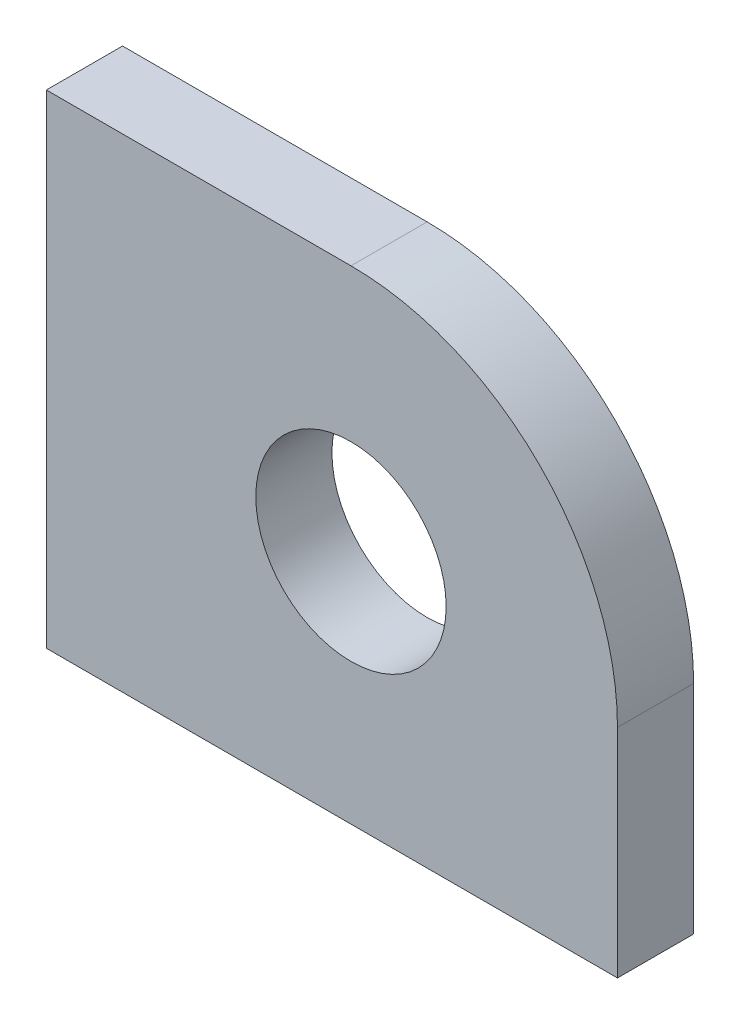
ISO-10303-21;
HEADER;
FILE_DESCRIPTION(('STEP AP214'),'2;1');
FILE_NAME('part.step','',(''),(''),'','','');
FILE_SCHEMA(('AUTOMOTIVE_DESIGN { 1 0 10303 214 1 1 1 1 }'));
ENDSEC;
DATA;
#1=APPLICATION_CONTEXT('core data for automotive mechanical design processes');
#2=APPLICATION_PROTOCOL_DEFINITION('international standard','automotive_design',2000,#1);
#3=PRODUCT_CONTEXT('',#1,'mechanical');
#4=PRODUCT('Part','Part','',(#3));
#5=PRODUCT_RELATED_PRODUCT_CATEGORY('part','',(#4));
#6=PRODUCT_DEFINITION_FORMATION('','',#4);
#7=PRODUCT_DEFINITION_CONTEXT('part definition',#1,'design');
#8=PRODUCT_DEFINITION('design','',#6,#7);
#9=PRODUCT_DEFINITION_SHAPE('','',#8);
#10=(LENGTH_UNIT() NAMED_UNIT(*) SI_UNIT(.MILLI.,.METRE.));
#11=(NAMED_UNIT(*) PLANE_ANGLE_UNIT() SI_UNIT($,.RADIAN.));
#12=(NAMED_UNIT(*) SI_UNIT($,.STERADIAN.) SOLID_ANGLE_UNIT());
#13=UNCERTAINTY_MEASURE_WITH_UNIT(LENGTH_MEASURE(1.E-05),#10,'distance_accuracy_value','');
#14=(GEOMETRIC_REPRESENTATION_CONTEXT(3) GLOBAL_UNCERTAINTY_ASSIGNED_CONTEXT((#13)) GLOBAL_UNIT_ASSIGNED_CONTEXT((#10,
#11,#12)) REPRESENTATION_CONTEXT('',''));
#15=CARTESIAN_POINT('',(0.,0.,0.));
#16=DIRECTION('',(0.,0.,1.));
#17=DIRECTION('',(1.,0.,0.));
#18=AXIS2_PLACEMENT_3D('',#15,#16,#17);
#19=CARTESIAN_POINT('',(0.,-4.99999999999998,20.));
#20=DIRECTION('',(0.,0.,-1.));
#21=DIRECTION('',(-1.,0.,0.));
#22=AXIS2_PLACEMENT_3D('',#19,#20,#21);
#23=PLANE('',#22);
#24=DIRECTION('',(0.,-1.,0.));
#25=VECTOR('',#24,1.);
#26=CARTESIAN_POINT('',(-80.,65.,20.));
#27=LINE('',#26,#25);
#28=CARTESIAN_POINT('',(-80.,65.,20.));
#29=VERTEX_POINT('',#28);
#30=CARTESIAN_POINT('',(-80.,-62.,20.));
#31=VERTEX_POINT('',#30);
#32=EDGE_CURVE('E116',#29,#31,#27,.T.);
#33=ORIENTED_EDGE('',*,*,#32,.T.);
#34=DIRECTION('',(1.,0.,0.));
#35=VECTOR('',#34,1.);
#36=CARTESIAN_POINT('',(70.,-62.,20.));
#37=LINE('',#36,#35);
#38=CARTESIAN_POINT('',(70.,-62.,20.));
#39=VERTEX_POINT('',#38);
#40=EDGE_CURVE('E83',#31,#39,#37,.T.);
#41=ORIENTED_EDGE('',*,*,#40,.T.);
#42=DIRECTION('',(0.,1.,0.));
#43=VECTOR('',#42,1.);
#44=CARTESIAN_POINT('',(70.,-5.00000000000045,20.));
#45=LINE('',#44,#43);
#46=CARTESIAN_POINT('',(70.,-5.00000000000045,20.));
#47=VERTEX_POINT('',#46);
#48=EDGE_CURVE('E87',#39,#47,#45,.T.);
#49=ORIENTED_EDGE('',*,*,#48,.T.);
#50=CARTESIAN_POINT('',(0.,-4.99999999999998,20.));
#51=DIRECTION('',(0.,0.,1.));
#52=DIRECTION('',(-1.,0.,0.));
#53=AXIS2_PLACEMENT_3D('',#50,#51,#52);
#54=CIRCLE('',#53,70.);
#55=CARTESIAN_POINT('',(-5.27756419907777E-13,65.,20.));
#56=VERTEX_POINT('',#55);
#57=EDGE_CURVE('E91',#47,#56,#54,.T.);
#58=ORIENTED_EDGE('',*,*,#57,.T.);
#59=DIRECTION('',(-1.,0.,0.));
#60=VECTOR('',#59,1.);
#61=CARTESIAN_POINT('',(-5.27355936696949E-13,65.,20.));
#62=LINE('',#61,#60);
#63=EDGE_CURVE('E49',#56,#29,#62,.T.);
#64=ORIENTED_EDGE('',*,*,#63,.T.);
#65=EDGE_LOOP('',(#33,#41,#49,#58,#64));
#66=FACE_BOUND('',#65,.T.);
#67=CARTESIAN_POINT('',(0.,0.,20.));
#68=DIRECTION('',(0.,0.,1.));
#69=DIRECTION('',(1.,0.,0.));
#70=AXIS2_PLACEMENT_3D('',#67,#68,#69);
#71=CIRCLE('',#70,25.);
#72=CARTESIAN_POINT('',(25.,0.,20.));
#73=VERTEX_POINT('',#72);
#74=EDGE_CURVE('E111',#73,#73,#71,.T.);
#75=ORIENTED_EDGE('',*,*,#74,.F.);
#76=EDGE_LOOP('',(#75));
#77=FACE_BOUND('',#76,.T.);
#78=ADVANCED_FACE('F32',(#66,#77),#23,.F.);
#79=CARTESIAN_POINT('',(0.,-4.99999999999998,0.));
#80=DIRECTION('',(0.,0.,-1.));
#81=DIRECTION('',(-1.,0.,0.));
#82=AXIS2_PLACEMENT_3D('',#79,#80,#81);
#83=PLANE('',#82);
#84=DIRECTION('',(0.,-1.,0.));
#85=VECTOR('',#84,1.);
#86=CARTESIAN_POINT('',(-80.,65.,0.));
#87=LINE('',#86,#85);
#88=CARTESIAN_POINT('',(-80.,65.,0.));
#89=VERTEX_POINT('',#88);
#90=CARTESIAN_POINT('',(-80.,-62.,0.));
#91=VERTEX_POINT('',#90);
#92=EDGE_CURVE('E107',#89,#91,#87,.T.);
#93=ORIENTED_EDGE('',*,*,#92,.F.);
#94=DIRECTION('',(-1.,0.,0.));
#95=VECTOR('',#94,1.);
#96=CARTESIAN_POINT('',(-5.27355936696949E-13,65.,0.));
#97=LINE('',#96,#95);
#98=CARTESIAN_POINT('',(-5.27756419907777E-13,65.,0.));
#99=VERTEX_POINT('',#98);
#100=EDGE_CURVE('E75',#99,#89,#97,.T.);
#101=ORIENTED_EDGE('',*,*,#100,.F.);
#102=CARTESIAN_POINT('',(0.,-4.99999999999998,0.));
#103=DIRECTION('',(0.,0.,1.));
#104=DIRECTION('',(-1.,0.,0.));
#105=AXIS2_PLACEMENT_3D('',#102,#103,#104);
#106=CIRCLE('',#105,70.);
#107=CARTESIAN_POINT('',(70.,-5.00000000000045,0.));
#108=VERTEX_POINT('',#107);
#109=EDGE_CURVE('E69',#108,#99,#106,.T.);
#110=ORIENTED_EDGE('',*,*,#109,.F.);
#111=DIRECTION('',(0.,1.,0.));
#112=VECTOR('',#111,1.);
#113=CARTESIAN_POINT('',(70.,-5.00000000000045,0.));
#114=LINE('',#113,#112);
#115=CARTESIAN_POINT('',(70.,-62.,0.));
#116=VERTEX_POINT('',#115);
#117=EDGE_CURVE('E98',#116,#108,#114,.T.);
#118=ORIENTED_EDGE('',*,*,#117,.F.);
#119=DIRECTION('',(1.,0.,0.));
#120=VECTOR('',#119,1.);
#121=CARTESIAN_POINT('',(70.,-62.,0.));
#122=LINE('',#121,#120);
#123=EDGE_CURVE('E110',#91,#116,#122,.T.);
#124=ORIENTED_EDGE('',*,*,#123,.F.);
#125=EDGE_LOOP('',(#93,#101,#110,#118,#124));
#126=FACE_BOUND('',#125,.T.);
#127=CARTESIAN_POINT('',(0.,0.,0.));
#128=DIRECTION('',(0.,0.,1.));
#129=DIRECTION('',(1.,0.,0.));
#130=AXIS2_PLACEMENT_3D('',#127,#128,#129);
#131=CIRCLE('',#130,25.);
#132=CARTESIAN_POINT('',(25.,0.,0.));
#133=VERTEX_POINT('',#132);
#134=EDGE_CURVE('E196',#133,#133,#131,.T.);
#135=ORIENTED_EDGE('',*,*,#134,.T.);
#136=EDGE_LOOP('',(#135));
#137=FACE_BOUND('',#136,.T.);
#138=ADVANCED_FACE('F120',(#126,#137),#83,.T.);
#139=CARTESIAN_POINT('',(-80.,65.,20.));
#140=DIRECTION('',(1.,0.,0.));
#141=DIRECTION('',(0.,1.,0.));
#142=AXIS2_PLACEMENT_3D('',#139,#140,#141);
#143=PLANE('',#142);
#144=ORIENTED_EDGE('',*,*,#92,.T.);
#145=DIRECTION('',(0.,0.,-1.));
#146=VECTOR('',#145,1.);
#147=CARTESIAN_POINT('',(-80.,-62.,20.));
#148=LINE('',#147,#146);
#149=EDGE_CURVE('E11',#31,#91,#148,.T.);
#150=ORIENTED_EDGE('',*,*,#149,.F.);
#151=ORIENTED_EDGE('',*,*,#32,.F.);
#152=DIRECTION('',(0.,0.,-1.));
#153=VECTOR('',#152,1.);
#154=CARTESIAN_POINT('',(-80.,65.,20.));
#155=LINE('',#154,#153);
#156=EDGE_CURVE('E103',#29,#89,#155,.T.);
#157=ORIENTED_EDGE('',*,*,#156,.T.);
#158=EDGE_LOOP('',(#144,#150,#151,#157));
#159=FACE_BOUND('',#158,.T.);
#160=ADVANCED_FACE('F34',(#159),#143,.F.);
#161=CARTESIAN_POINT('',(70.,-62.,20.));
#162=DIRECTION('',(0.,1.,0.));
#163=DIRECTION('',(-1.,0.,0.));
#164=AXIS2_PLACEMENT_3D('',#161,#162,#163);
#165=PLANE('',#164);
#166=ORIENTED_EDGE('',*,*,#123,.T.);
#167=DIRECTION('',(0.,0.,-1.));
#168=VECTOR('',#167,1.);
#169=CARTESIAN_POINT('',(70.,-62.,20.));
#170=LINE('',#169,#168);
#171=EDGE_CURVE('E41',#39,#116,#170,.T.);
#172=ORIENTED_EDGE('',*,*,#171,.F.);
#173=ORIENTED_EDGE('',*,*,#40,.F.);
#174=ORIENTED_EDGE('',*,*,#149,.T.);
#175=EDGE_LOOP('',(#166,#172,#173,#174));
#176=FACE_BOUND('',#175,.T.);
#177=ADVANCED_FACE('F145',(#176),#165,.F.);
#178=CARTESIAN_POINT('',(70.,-5.00000000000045,20.));
#179=DIRECTION('',(-1.,0.,0.));
#180=DIRECTION('',(0.,-1.,0.));
#181=AXIS2_PLACEMENT_3D('',#178,#179,#180);
#182=PLANE('',#181);
#183=ORIENTED_EDGE('',*,*,#117,.T.);
#184=DIRECTION('',(0.,0.,-1.));
#185=VECTOR('',#184,1.);
#186=CARTESIAN_POINT('',(70.,-5.00000000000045,20.));
#187=LINE('',#186,#185);
#188=EDGE_CURVE('E95',#47,#108,#187,.T.);
#189=ORIENTED_EDGE('',*,*,#188,.F.);
#190=ORIENTED_EDGE('',*,*,#48,.F.);
#191=ORIENTED_EDGE('',*,*,#171,.T.);
#192=EDGE_LOOP('',(#183,#189,#190,#191));
#193=FACE_BOUND('',#192,.T.);
#194=ADVANCED_FACE('F96',(#193),#182,.F.);
#195=CARTESIAN_POINT('',(0.,-4.99999999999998,20.));
#196=DIRECTION('',(0.,0.,-1.));
#197=DIRECTION('',(-1.,0.,0.));
#198=AXIS2_PLACEMENT_3D('',#195,#196,#197);
#199=CYLINDRICAL_SURFACE('',#198,70.);
#200=ORIENTED_EDGE('',*,*,#109,.T.);
#201=DIRECTION('',(0.,0.,-1.));
#202=VECTOR('',#201,1.);
#203=CARTESIAN_POINT('',(-5.27756419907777E-13,65.,20.));
#204=LINE('',#203,#202);
#205=EDGE_CURVE('E99',#56,#99,#204,.T.);
#206=ORIENTED_EDGE('',*,*,#205,.F.);
#207=ORIENTED_EDGE('',*,*,#57,.F.);
#208=ORIENTED_EDGE('',*,*,#188,.T.);
#209=EDGE_LOOP('',(#200,#206,#207,#208));
#210=FACE_BOUND('',#209,.T.);
#211=ADVANCED_FACE('F101',(#210),#199,.T.);
#212=CARTESIAN_POINT('',(-5.27355936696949E-13,65.,20.));
#213=DIRECTION('',(0.,-1.,0.));
#214=DIRECTION('',(1.,0.,0.));
#215=AXIS2_PLACEMENT_3D('',#212,#213,#214);
#216=PLANE('',#215);
#217=ORIENTED_EDGE('',*,*,#100,.T.);
#218=ORIENTED_EDGE('',*,*,#156,.F.);
#219=ORIENTED_EDGE('',*,*,#63,.F.);
#220=ORIENTED_EDGE('',*,*,#205,.T.);
#221=EDGE_LOOP('',(#217,#218,#219,#220));
#222=FACE_BOUND('',#221,.T.);
#223=ADVANCED_FACE('F125',(#222),#216,.F.);
#224=CARTESIAN_POINT('',(0.,0.,20.));
#225=DIRECTION('',(0.,0.,-1.));
#226=DIRECTION('',(-1.,0.,0.));
#227=AXIS2_PLACEMENT_3D('',#224,#225,#226);
#228=CYLINDRICAL_SURFACE('',#227,25.);
#229=ORIENTED_EDGE('',*,*,#74,.T.);
#230=EDGE_LOOP('',(#229));
#231=FACE_BOUND('',#230,.T.);
#232=ORIENTED_EDGE('',*,*,#134,.F.);
#233=EDGE_LOOP('',(#232));
#234=FACE_BOUND('',#233,.T.);
#235=ADVANCED_FACE('F127',(#231,#234),#228,.F.);
#236=CLOSED_SHELL('',(#78,#138,#160,#177,#194,#211,#223,#235));
#237=MANIFOLD_SOLID_BREP('B2',#236);
#238=ADVANCED_BREP_SHAPE_REPRESENTATION('',(#18,#237),#14);
#239=SHAPE_DEFINITION_REPRESENTATION(#9,#238);
ENDSEC;
END-ISO-10303-21;
